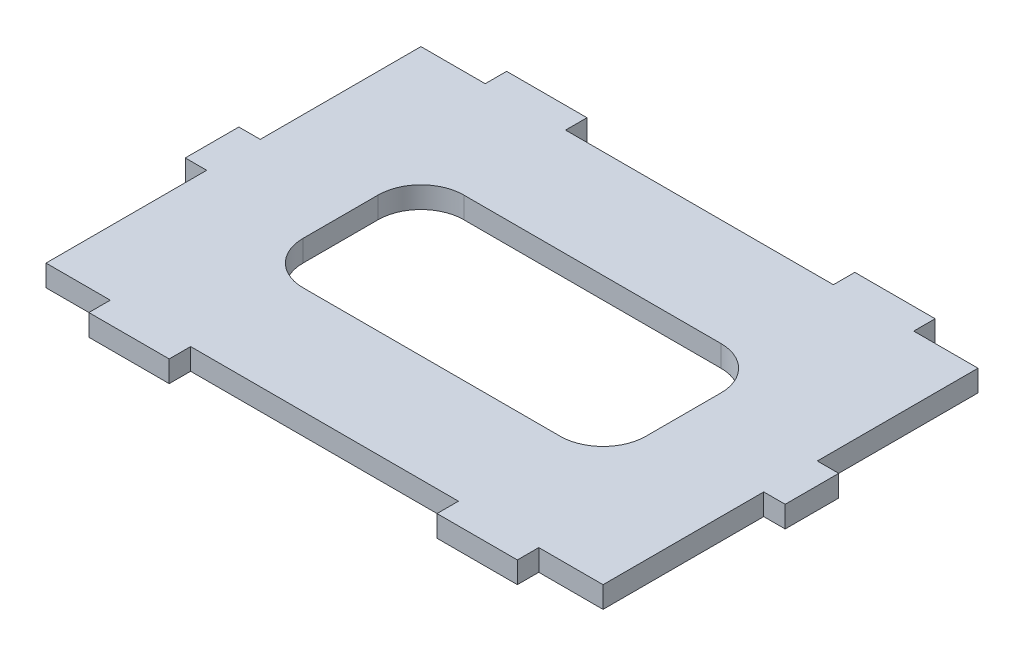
from build123d import *

# Parameters (mm, degrees)
AUFSATZ_LINEAR_AUSTRAGEN1_DEPTH = 4


with BuildPart() as part:
    # Skizze1 → Aufsatz-Linear austragen1 (new body)
    with BuildSketch(Plane(origin=(0, 0, 0), x_dir=(1, 0, 0), z_dir=(0, 1, 0))):
        Polygon((-52, 35), (-40, 35), (-40, 39), (-25, 39), (-25, 35), (25, 35), (25, 39), (40, 39), (40, 35), (52, 35), (52, 5), (56, 5), (56, -5), (52, -5), (52, -35), (40, -35), (40, -39), (25, -39), (25, -35), (-25, -35), (-25, -39), (-40, -39), (-40, -35), (-52, -35), (-52, -5), (-56, -5), (-56, 5), (-52, 5), align=None)
        with BuildLine():
            Line((-24, 15), (24, 15))
            ThreePointArc((24, 15), (29.656854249, 12.656854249), (32, 7))
            Line((32, 7), (32, -7))
            ThreePointArc((32, -7), (29.656854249, -12.656854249), (24, -15))
            Line((24, -15), (-24, -15))
            ThreePointArc((-24, -15), (-29.656854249, -12.656854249), (-32, -7))
            Line((-32, -7), (-32, 7))
            ThreePointArc((-32, 7), (-29.656854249, 12.656854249), (-24, 15))
        make_face(mode=Mode.SUBTRACT)
    extrude(amount=AUFSATZ_LINEAR_AUSTRAGEN1_DEPTH)


solid = part.part
